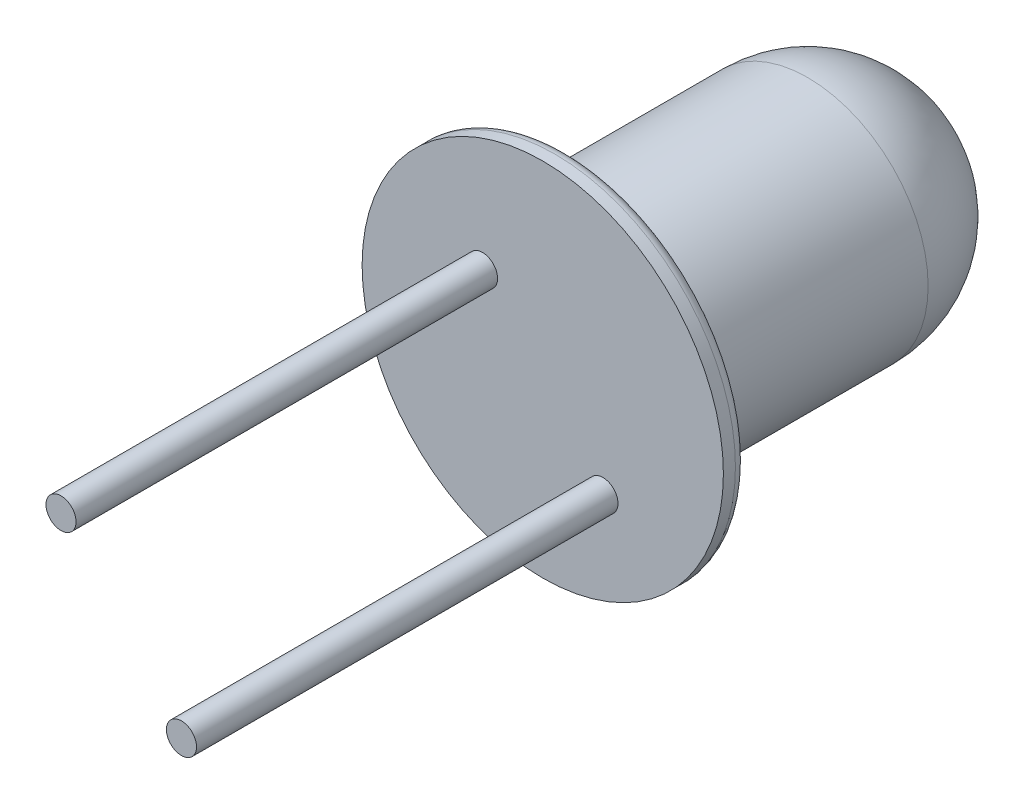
from build123d import *

# Parameters (mm, degrees)
SKIZZE4_R               = 1
LINEAR_AUSTRAGEN1_DEPTH = 3
VERRUNDUNG3_R           = 1
SKIZZE5_R               = 1.5
LINEAR_AUSTRAGEN2_DEPTH = 0.2
VERRUNDUNG6_R           = 0.1
VERRUNDUNG7_R           = 0.1
SKIZZE6_R               = 0.125
LINEAR_AUSTRAGEN3_DEPTH = 3.5


with BuildPart() as part:
    # Skizze4 → Linear austragen1 (new body)
    with BuildSketch(Plane.XY):
        with Locations((12.21849027, 5.672413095)):
            Circle(SKIZZE4_R)
    extrude(amount=-LINEAR_AUSTRAGEN1_DEPTH)

    # Verrundung3
    verrundung3_edges = [part.edges().sort_by_distance(p)[0] for p in [
        (11.21849027, 5.672413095, -3),
    ]]
    fillet(verrundung3_edges, radius=VERRUNDUNG3_R)

    # Skizze5 → Linear austragen2 (add)
    with BuildSketch(Plane.XY):
        with Locations((12.21849027, 5.672413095)):
            Circle(SKIZZE5_R)
    extrude(amount=LINEAR_AUSTRAGEN2_DEPTH)

    # Verrundung6
    verrundung6_edges = [part.edges().sort_by_distance(p)[0] for p in [
        (10.71849027, 5.672413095, 0),
    ]]
    fillet(verrundung6_edges, radius=VERRUNDUNG6_R)

    # Verrundung7
    verrundung7_edges = [part.edges().sort_by_distance(p)[0] for p in [
        (11.21849027, 5.672413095, 0),
    ]]
    fillet(verrundung7_edges, radius=VERRUNDUNG7_R)

    # Skizze6 → Linear austragen3 (add)
    with BuildSketch(Plane.XY.offset(0.2)):
        with Locations((11.71849027, 6.139159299)):
            Circle(SKIZZE6_R)
        with Locations((12.71849027, 5.02112531)):
            Circle(SKIZZE6_R)
    extrude(amount=LINEAR_AUSTRAGEN3_DEPTH)


solid = part.part
